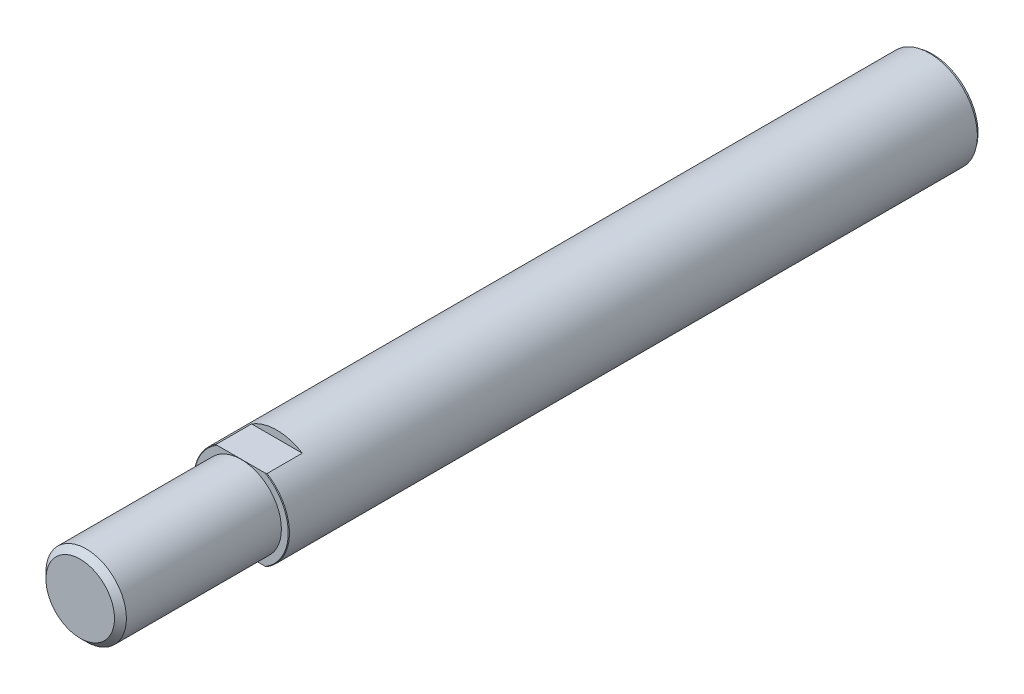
ISO-10303-21;
HEADER;
FILE_DESCRIPTION(('STEP AP214'),'2;1');
FILE_NAME('part.step','',(''),(''),'','','');
FILE_SCHEMA(('AUTOMOTIVE_DESIGN { 1 0 10303 214 1 1 1 1 }'));
ENDSEC;
DATA;
#1=APPLICATION_CONTEXT('core data for automotive mechanical design processes');
#2=APPLICATION_PROTOCOL_DEFINITION('international standard','automotive_design',2000,#1);
#3=PRODUCT_CONTEXT('',#1,'mechanical');
#4=PRODUCT('Part','Part','',(#3));
#5=PRODUCT_RELATED_PRODUCT_CATEGORY('part','',(#4));
#6=PRODUCT_DEFINITION_FORMATION('','',#4);
#7=PRODUCT_DEFINITION_CONTEXT('part definition',#1,'design');
#8=PRODUCT_DEFINITION('design','',#6,#7);
#9=PRODUCT_DEFINITION_SHAPE('','',#8);
#10=(LENGTH_UNIT() NAMED_UNIT(*) SI_UNIT(.MILLI.,.METRE.));
#11=(NAMED_UNIT(*) PLANE_ANGLE_UNIT() SI_UNIT($,.RADIAN.));
#12=(NAMED_UNIT(*) SI_UNIT($,.STERADIAN.) SOLID_ANGLE_UNIT());
#13=UNCERTAINTY_MEASURE_WITH_UNIT(LENGTH_MEASURE(1.E-05),#10,'distance_accuracy_value','');
#14=(GEOMETRIC_REPRESENTATION_CONTEXT(3) GLOBAL_UNCERTAINTY_ASSIGNED_CONTEXT((#13)) GLOBAL_UNIT_ASSIGNED_CONTEXT((#10,
#11,#12)) REPRESENTATION_CONTEXT('',''));
#15=CARTESIAN_POINT('',(0.,0.,0.));
#16=DIRECTION('',(0.,0.,1.));
#17=DIRECTION('',(1.,0.,0.));
#18=AXIS2_PLACEMENT_3D('',#15,#16,#17);
#19=CARTESIAN_POINT('',(0.,0.,286.));
#20=DIRECTION('',(0.,0.,-1.));
#21=DIRECTION('',(-1.,0.,0.));
#22=AXIS2_PLACEMENT_3D('',#19,#20,#21);
#23=CYLINDRICAL_SURFACE('',#22,16.);
#24=DIRECTION('',(0.,0.,-1.));
#25=VECTOR('',#24,1.);
#26=CARTESIAN_POINT('',(-8.50867204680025,-13.55,286.));
#27=LINE('',#26,#25);
#28=CARTESIAN_POINT('',(-8.50867204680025,-13.55,231.8));
#29=VERTEX_POINT('',#28);
#30=CARTESIAN_POINT('',(-8.50867204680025,-13.55,220.));
#31=VERTEX_POINT('',#30);
#32=EDGE_CURVE('E133',#29,#31,#27,.T.);
#33=ORIENTED_EDGE('',*,*,#32,.F.);
#34=CARTESIAN_POINT('',(0.,0.,231.8));
#35=DIRECTION('',(0.,0.,1.));
#36=DIRECTION('',(1.,0.,0.));
#37=AXIS2_PLACEMENT_3D('',#34,#35,#36);
#38=CIRCLE('',#37,16.);
#39=CARTESIAN_POINT('',(-8.50867204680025,13.55,231.8));
#40=VERTEX_POINT('',#39);
#41=EDGE_CURVE('E145',#29,#40,#38,.F.);
#42=ORIENTED_EDGE('',*,*,#41,.T.);
#43=DIRECTION('',(0.,0.,-1.));
#44=VECTOR('',#43,1.);
#45=CARTESIAN_POINT('',(-8.50867204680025,13.55,286.));
#46=LINE('',#45,#44);
#47=CARTESIAN_POINT('',(-8.50867204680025,13.55,220.));
#48=VERTEX_POINT('',#47);
#49=EDGE_CURVE('E58',#48,#40,#46,.F.);
#50=ORIENTED_EDGE('',*,*,#49,.F.);
#51=CARTESIAN_POINT('',(0.,0.,220.));
#52=DIRECTION('',(0.,0.,1.));
#53=DIRECTION('',(1.,0.,0.));
#54=AXIS2_PLACEMENT_3D('',#51,#52,#53);
#55=CIRCLE('',#54,16.);
#56=CARTESIAN_POINT('',(8.50867204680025,13.55,220.));
#57=VERTEX_POINT('',#56);
#58=EDGE_CURVE('E51',#57,#48,#55,.T.);
#59=ORIENTED_EDGE('',*,*,#58,.F.);
#60=DIRECTION('',(0.,0.,-1.));
#61=VECTOR('',#60,1.);
#62=CARTESIAN_POINT('',(8.50867204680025,13.55,286.));
#63=LINE('',#62,#61);
#64=CARTESIAN_POINT('',(8.50867204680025,13.55,231.8));
#65=VERTEX_POINT('',#64);
#66=EDGE_CURVE('E130',#65,#57,#63,.T.);
#67=ORIENTED_EDGE('',*,*,#66,.F.);
#68=CARTESIAN_POINT('',(8.50867204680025,-13.55,231.8));
#69=VERTEX_POINT('',#68);
#70=EDGE_CURVE('E142',#65,#69,#38,.F.);
#71=ORIENTED_EDGE('',*,*,#70,.T.);
#72=DIRECTION('',(0.,0.,-1.));
#73=VECTOR('',#72,1.);
#74=CARTESIAN_POINT('',(8.50867204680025,-13.55,286.));
#75=LINE('',#74,#73);
#76=CARTESIAN_POINT('',(8.50867204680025,-13.55,220.));
#77=VERTEX_POINT('',#76);
#78=EDGE_CURVE('E66',#77,#69,#75,.F.);
#79=ORIENTED_EDGE('',*,*,#78,.F.);
#80=EDGE_CURVE('E12',#31,#77,#55,.T.);
#81=ORIENTED_EDGE('',*,*,#80,.F.);
#82=EDGE_LOOP('',(#33,#42,#50,#59,#67,#71,#79,#81));
#83=FACE_BOUND('',#82,.T.);
#84=CARTESIAN_POINT('',(0.,0.,1.));
#85=DIRECTION('',(0.,0.,-1.));
#86=DIRECTION('',(-1.,0.,0.));
#87=AXIS2_PLACEMENT_3D('',#84,#85,#86);
#88=CIRCLE('',#87,16.);
#89=CARTESIAN_POINT('',(-16.,0.,1.));
#90=VERTEX_POINT('',#89);
#91=EDGE_CURVE('E46',#90,#90,#88,.T.);
#92=ORIENTED_EDGE('',*,*,#91,.F.);
#93=EDGE_LOOP('',(#92));
#94=FACE_BOUND('',#93,.T.);
#95=ADVANCED_FACE('F42',(#83,#94),#23,.T.);
#96=CARTESIAN_POINT('',(0.,0.,232.));
#97=DIRECTION('',(0.,0.,1.));
#98=DIRECTION('',(1.,0.,0.));
#99=AXIS2_PLACEMENT_3D('',#96,#97,#98);
#100=PLANE('',#99);
#101=CARTESIAN_POINT('',(0.,0.,232.));
#102=DIRECTION('',(0.,0.,1.));
#103=DIRECTION('',(1.,0.,0.));
#104=AXIS2_PLACEMENT_3D('',#101,#102,#103);
#105=CIRCLE('',#104,13.5);
#106=CARTESIAN_POINT('',(13.5,0.,232.));
#107=VERTEX_POINT('',#106);
#108=EDGE_CURVE('E135',#107,#107,#105,.T.);
#109=ORIENTED_EDGE('',*,*,#108,.F.);
#110=EDGE_LOOP('',(#109));
#111=FACE_BOUND('',#110,.T.);
#112=CARTESIAN_POINT('',(0.,0.,232.));
#113=DIRECTION('',(0.,0.,1.));
#114=DIRECTION('',(1.,0.,0.));
#115=AXIS2_PLACEMENT_3D('',#112,#113,#114);
#116=CIRCLE('',#115,15.8);
#117=CARTESIAN_POINT('',(-8.12634604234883,13.55,232.));
#118=VERTEX_POINT('',#117);
#119=CARTESIAN_POINT('',(-8.12634604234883,-13.55,232.));
#120=VERTEX_POINT('',#119);
#121=EDGE_CURVE('E141',#118,#120,#116,.T.);
#122=ORIENTED_EDGE('',*,*,#121,.T.);
#123=DIRECTION('',(1.,0.,0.));
#124=VECTOR('',#123,1.);
#125=CARTESIAN_POINT('',(-21.7985101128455,-13.55,232.));
#126=LINE('',#125,#124);
#127=CARTESIAN_POINT('',(8.12634604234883,-13.55,232.));
#128=VERTEX_POINT('',#127);
#129=EDGE_CURVE('E122',#120,#128,#126,.T.);
#130=ORIENTED_EDGE('',*,*,#129,.T.);
#131=CARTESIAN_POINT('',(8.12634604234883,13.55,232.));
#132=VERTEX_POINT('',#131);
#133=EDGE_CURVE('E138',#128,#132,#116,.T.);
#134=ORIENTED_EDGE('',*,*,#133,.T.);
#135=DIRECTION('',(-1.,0.,0.));
#136=VECTOR('',#135,1.);
#137=CARTESIAN_POINT('',(-21.7985101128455,13.55,232.));
#138=LINE('',#137,#136);
#139=EDGE_CURVE('E124',#132,#118,#138,.T.);
#140=ORIENTED_EDGE('',*,*,#139,.T.);
#141=EDGE_LOOP('',(#122,#130,#134,#140));
#142=FACE_BOUND('',#141,.T.);
#143=ADVANCED_FACE('F187',(#111,#142),#100,.T.);
#144=CARTESIAN_POINT('',(0.,0.,232.));
#145=DIRECTION('',(0.,0.,-1.));
#146=DIRECTION('',(-1.,0.,0.));
#147=AXIS2_PLACEMENT_3D('',#144,#145,#146);
#148=CONICAL_SURFACE('',#147,15.8,0.785398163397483);
#149=ORIENTED_EDGE('',*,*,#41,.F.);
#150=CARTESIAN_POINT('',(-32.488120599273,-13.55,212.599425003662));
#151=CARTESIAN_POINT('',(-32.0037413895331,-13.55,213.046466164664));
#152=CARTESIAN_POINT('',(-31.5186355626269,-13.55,213.492721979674));
#153=CARTESIAN_POINT('',(-30.5467487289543,-13.55,214.383412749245));
#154=CARTESIAN_POINT('',(-30.0599677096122,-13.55,214.827847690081));
#155=CARTESIAN_POINT('',(-29.0844075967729,-13.55,215.714738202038));
#156=CARTESIAN_POINT('',(-28.5956280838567,-13.55,216.157193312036));
#157=CARTESIAN_POINT('',(-27.6159099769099,-13.55,217.039705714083));
#158=CARTESIAN_POINT('',(-27.1249713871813,-13.55,217.479763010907));
#159=CARTESIAN_POINT('',(-26.1376779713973,-13.55,218.359716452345));
#160=CARTESIAN_POINT('',(-25.6413083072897,-13.55,218.799595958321));
#161=CARTESIAN_POINT('',(-24.6456712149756,-13.55,219.676063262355));
#162=CARTESIAN_POINT('',(-24.1464037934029,-13.55,220.112651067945));
#163=CARTESIAN_POINT('',(-23.1445514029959,-13.55,220.981895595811));
#164=CARTESIAN_POINT('',(-22.6419668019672,-13.55,221.414552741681));
#165=CARTESIAN_POINT('',(-21.6328509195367,-13.55,222.275241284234));
#166=CARTESIAN_POINT('',(-21.1263196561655,-13.55,222.703272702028));
#167=CARTESIAN_POINT('',(-20.2065441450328,-13.55,223.47190847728));
#168=CARTESIAN_POINT('',(-19.7941106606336,-13.55,223.813482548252));
#169=CARTESIAN_POINT('',(-18.9657498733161,-13.55,224.492365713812));
#170=CARTESIAN_POINT('',(-18.549822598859,-13.55,224.829674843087));
#171=CARTESIAN_POINT('',(-17.7138194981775,-13.55,225.499343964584));
#172=CARTESIAN_POINT('',(-17.2937426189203,-13.55,225.831702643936));
#173=CARTESIAN_POINT('',(-16.4488978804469,-13.55,226.490407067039));
#174=CARTESIAN_POINT('',(-16.024130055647,-13.55,226.816752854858));
#175=CARTESIAN_POINT('',(-15.1695807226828,-13.55,227.461853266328));
#176=CARTESIAN_POINT('',(-14.7398051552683,-13.55,227.780615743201));
#177=CARTESIAN_POINT('',(-13.8738331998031,-13.55,228.409356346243));
#178=CARTESIAN_POINT('',(-13.4376365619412,-13.55,228.719334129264));
#179=CARTESIAN_POINT('',(-12.5579047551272,-13.55,229.328326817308));
#180=CARTESIAN_POINT('',(-12.1143727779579,-13.55,229.627346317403));
#181=CARTESIAN_POINT('',(-11.2185195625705,-13.55,230.211866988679));
#182=CARTESIAN_POINT('',(-10.7661993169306,-13.55,230.497369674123));
#183=CARTESIAN_POINT('',(-9.85664429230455,-13.55,231.048090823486));
#184=CARTESIAN_POINT('',(-9.3995316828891,-13.55,231.313509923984));
#185=CARTESIAN_POINT('',(-8.47356619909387,-13.55,231.823316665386));
#186=CARTESIAN_POINT('',(-8.00471203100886,-13.55,232.067701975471));
#187=CARTESIAN_POINT('',(-7.05420360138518,-13.55,232.529379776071));
#188=CARTESIAN_POINT('',(-6.5725601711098,-13.55,232.746694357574));
#189=CARTESIAN_POINT('',(-5.59514687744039,-13.55,233.147025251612));
#190=CARTESIAN_POINT('',(-5.09938115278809,-13.55,233.330051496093));
#191=CARTESIAN_POINT('',(-4.2033265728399,-13.55,233.61790524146));
#192=CARTESIAN_POINT('',(-3.80573534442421,-13.55,233.731082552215));
#193=CARTESIAN_POINT('',(-3.00299960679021,-13.55,233.926675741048));
#194=CARTESIAN_POINT('',(-2.59785608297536,-13.55,234.009095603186));
#195=CARTESIAN_POINT('',(-1.7832189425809,-13.55,234.139058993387));
#196=CARTESIAN_POINT('',(-1.37374267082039,-13.55,234.186709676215));
#197=CARTESIAN_POINT('',(-0.552137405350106,-13.55,234.244944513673));
#198=CARTESIAN_POINT('',(-0.140008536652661,-13.55,234.255530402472));
#199=CARTESIAN_POINT('',(0.684252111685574,-13.55,234.239005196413));
#200=CARTESIAN_POINT('',(1.09638245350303,-13.55,234.211823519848));
#201=CARTESIAN_POINT('',(1.91660475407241,-13.55,234.121198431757));
#202=CARTESIAN_POINT('',(2.32469637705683,-13.55,234.057752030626));
#203=CARTESIAN_POINT('',(3.13552365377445,-13.55,233.897646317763));
#204=CARTESIAN_POINT('',(3.53823895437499,-13.55,233.800885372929));
#205=CARTESIAN_POINT('',(4.33550774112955,-13.55,233.57845044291));
#206=CARTESIAN_POINT('',(4.73006100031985,-13.55,233.452775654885));
#207=CARTESIAN_POINT('',(5.5684622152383,-13.55,233.156422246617));
#208=CARTESIAN_POINT('',(6.01091651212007,-13.55,232.981830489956));
#209=CARTESIAN_POINT('',(6.88464582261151,-13.55,232.606413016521));
#210=CARTESIAN_POINT('',(7.315915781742,-13.55,232.405575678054));
#211=CARTESIAN_POINT('',(8.1686875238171,-13.55,231.982520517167));
#212=CARTESIAN_POINT('',(8.59017113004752,-13.55,231.760266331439));
#213=CARTESIAN_POINT('',(9.42365509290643,-13.55,231.298868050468));
#214=CARTESIAN_POINT('',(9.83565671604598,-13.55,231.059726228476));
#215=CARTESIAN_POINT('',(10.6563740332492,-13.55,230.564792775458));
#216=CARTESIAN_POINT('',(11.0649881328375,-13.55,230.308833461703));
#217=CARTESIAN_POINT('',(11.8748731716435,-13.55,229.785572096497));
#218=CARTESIAN_POINT('',(12.2761439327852,-13.55,229.518269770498));
#219=CARTESIAN_POINT('',(13.0719274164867,-13.55,228.974659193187));
#220=CARTESIAN_POINT('',(13.4664465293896,-13.55,228.698360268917));
#221=CARTESIAN_POINT('',(14.2499951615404,-13.55,228.138111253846));
#222=CARTESIAN_POINT('',(14.6390247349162,-13.55,227.854161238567));
#223=CARTESIAN_POINT('',(15.4205821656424,-13.55,227.273750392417));
#224=CARTESIAN_POINT('',(15.8130076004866,-13.55,226.977151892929));
#225=CARTESIAN_POINT('',(16.5935743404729,-13.55,226.378362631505));
#226=CARTESIAN_POINT('',(16.9817155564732,-13.55,226.076171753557));
#227=CARTESIAN_POINT('',(17.7542964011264,-13.55,225.467040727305));
#228=CARTESIAN_POINT('',(18.1387357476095,-13.55,225.160100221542));
#229=CARTESIAN_POINT('',(18.904356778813,-13.55,224.542179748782));
#230=CARTESIAN_POINT('',(19.2855384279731,-13.55,224.231199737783));
#231=CARTESIAN_POINT('',(20.4253968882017,-13.55,223.292597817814));
#232=CARTESIAN_POINT('',(21.1797977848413,-13.55,222.659781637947));
#233=CARTESIAN_POINT('',(22.6797481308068,-13.55,221.383746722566));
#234=CARTESIAN_POINT('',(23.4252973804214,-13.55,220.740527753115));
#235=CARTESIAN_POINT('',(24.5192457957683,-13.55,219.786316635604));
#236=CARTESIAN_POINT('',(24.870373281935,-13.55,219.478444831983));
#237=CARTESIAN_POINT('',(25.5711940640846,-13.55,218.861082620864));
#238=CARTESIAN_POINT('',(25.9208873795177,-13.55,218.551592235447));
#239=CARTESIAN_POINT('',(26.9680519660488,-13.55,217.620937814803));
#240=CARTESIAN_POINT('',(27.6635941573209,-13.55,216.997602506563));
#241=CARTESIAN_POINT('',(29.049310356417,-13.55,215.747297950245));
#242=CARTESIAN_POINT('',(29.7394913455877,-13.55,215.120336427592));
#243=CARTESIAN_POINT('',(31.1162973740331,-13.55,213.862571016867));
#244=CARTESIAN_POINT('',(31.8029225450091,-13.55,213.231767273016));
#245=CARTESIAN_POINT('',(32.488120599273,-13.55,212.599425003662));
#246=B_SPLINE_CURVE_WITH_KNOTS('',3,(#150,#151,#152,#153,#154,#155,#156,#157,#158,#159,#160,
#161,#162,#163,#164,#165,#166,#167,#168,#169,#170,#171,#172,#173,#174,#175,#176,#177,#178,#179,
#180,#181,#182,#183,#184,#185,#186,#187,#188,#189,#190,#191,#192,#193,#194,#195,#196,#197,#198,
#199,#200,#201,#202,#203,#204,#205,#206,#207,#208,#209,#210,#211,#212,#213,#214,#215,#216,#217,
#218,#219,#220,#221,#222,#223,#224,#225,#226,#227,#228,#229,#230,#231,#232,#233,#234,#235,#236,
#237,#238,#239,#240,#241,#242,#243,#244,#245),.UNSPECIFIED.,.F.,.F.,(4,2,2,2,2,2,2,2,2,2,2,2,2,
2,2,2,2,2,2,2,2,2,2,2,2,2,2,2,2,2,2,2,2,2,2,2,2,2,2,2,2,2,2,2,2,2,2,4),(0.,1.97742902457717,
3.95487292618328,5.93275563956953,7.91063441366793,9.9003183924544,11.8899978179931,
13.8794602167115,15.8689135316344,17.4754290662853,19.081931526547,20.688852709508,
22.2957621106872,23.9009277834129,25.5061560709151,27.1107033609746,28.7150704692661,
30.3003831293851,31.8858712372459,33.4700569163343,35.0537830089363,36.2929033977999,
37.5318632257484,38.7669884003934,40.0020557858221,41.2394344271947,42.4769150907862,
43.7182049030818,44.9595291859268,46.3854300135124,47.8119643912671,49.2409650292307,
50.6697736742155,52.1160334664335,53.5623282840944,55.0071686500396,56.4519947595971,
57.9276439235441,59.403323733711,60.8791151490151,62.3549226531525,65.3087944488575,
68.2627327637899,69.6636854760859,71.0646191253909,73.8665410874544,76.6638239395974,
79.4610024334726),.UNSPECIFIED.);
#247=EDGE_CURVE('E337',#29,#120,#246,.T.);
#248=ORIENTED_EDGE('',*,*,#247,.T.);
#249=ORIENTED_EDGE('',*,*,#121,.F.);
#250=CARTESIAN_POINT('',(32.488120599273,13.55,212.599425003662));
#251=CARTESIAN_POINT('',(32.0037413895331,13.55,213.046466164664));
#252=CARTESIAN_POINT('',(31.5186355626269,13.55,213.492721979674));
#253=CARTESIAN_POINT('',(30.5467487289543,13.55,214.383412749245));
#254=CARTESIAN_POINT('',(30.0599677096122,13.55,214.827847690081));
#255=CARTESIAN_POINT('',(29.0844075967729,13.55,215.714738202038));
#256=CARTESIAN_POINT('',(28.5956280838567,13.55,216.157193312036));
#257=CARTESIAN_POINT('',(27.6159099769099,13.55,217.039705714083));
#258=CARTESIAN_POINT('',(27.1249713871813,13.55,217.479763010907));
#259=CARTESIAN_POINT('',(26.1376779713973,13.55,218.359716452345));
#260=CARTESIAN_POINT('',(25.6413083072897,13.55,218.799595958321));
#261=CARTESIAN_POINT('',(24.6456712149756,13.55,219.676063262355));
#262=CARTESIAN_POINT('',(24.1464037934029,13.55,220.112651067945));
#263=CARTESIAN_POINT('',(23.1445514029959,13.55,220.981895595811));
#264=CARTESIAN_POINT('',(22.6419668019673,13.55,221.414552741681));
#265=CARTESIAN_POINT('',(21.6328509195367,13.55,222.275241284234));
#266=CARTESIAN_POINT('',(21.1263196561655,13.55,222.703272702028));
#267=CARTESIAN_POINT('',(20.2065441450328,13.55,223.47190847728));
#268=CARTESIAN_POINT('',(19.7941106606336,13.55,223.813482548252));
#269=CARTESIAN_POINT('',(18.965749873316,13.55,224.492365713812));
#270=CARTESIAN_POINT('',(18.549822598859,13.55,224.829674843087));
#271=CARTESIAN_POINT('',(17.7138194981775,13.55,225.499343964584));
#272=CARTESIAN_POINT('',(17.2937426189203,13.55,225.831702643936));
#273=CARTESIAN_POINT('',(16.4488978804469,13.55,226.490407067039));
#274=CARTESIAN_POINT('',(16.024130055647,13.55,226.816752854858));
#275=CARTESIAN_POINT('',(15.1695807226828,13.55,227.461853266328));
#276=CARTESIAN_POINT('',(14.7398051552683,13.55,227.780615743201));
#277=CARTESIAN_POINT('',(13.8738331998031,13.55,228.409356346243));
#278=CARTESIAN_POINT('',(13.4376365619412,13.55,228.719334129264));
#279=CARTESIAN_POINT('',(12.5579047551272,13.55,229.328326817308));
#280=CARTESIAN_POINT('',(12.1143727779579,13.55,229.627346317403));
#281=CARTESIAN_POINT('',(11.2185195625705,13.55,230.211866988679));
#282=CARTESIAN_POINT('',(10.7661993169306,13.55,230.497369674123));
#283=CARTESIAN_POINT('',(9.85664429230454,13.55,231.048090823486));
#284=CARTESIAN_POINT('',(9.3995316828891,13.55,231.313509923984));
#285=CARTESIAN_POINT('',(8.47356619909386,13.55,231.823316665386));
#286=CARTESIAN_POINT('',(8.00471203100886,13.55,232.067701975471));
#287=CARTESIAN_POINT('',(7.05420360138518,13.55,232.529379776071));
#288=CARTESIAN_POINT('',(6.57256017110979,13.55,232.746694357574));
#289=CARTESIAN_POINT('',(5.59514687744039,13.55,233.147025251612));
#290=CARTESIAN_POINT('',(5.09938115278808,13.55,233.330051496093));
#291=CARTESIAN_POINT('',(4.20332657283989,13.55,233.61790524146));
#292=CARTESIAN_POINT('',(3.80573534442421,13.55,233.731082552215));
#293=CARTESIAN_POINT('',(3.00299960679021,13.55,233.926675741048));
#294=CARTESIAN_POINT('',(2.59785608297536,13.55,234.009095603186));
#295=CARTESIAN_POINT('',(1.7832189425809,13.55,234.139058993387));
#296=CARTESIAN_POINT('',(1.3737426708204,13.55,234.186709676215));
#297=CARTESIAN_POINT('',(0.552137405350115,13.55,234.244944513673));
#298=CARTESIAN_POINT('',(0.14000853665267,13.55,234.255530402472));
#299=CARTESIAN_POINT('',(-0.684252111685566,13.55,234.239005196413));
#300=CARTESIAN_POINT('',(-1.09638245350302,13.55,234.211823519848));
#301=CARTESIAN_POINT('',(-1.9166047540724,13.55,234.121198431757));
#302=CARTESIAN_POINT('',(-2.32469637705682,13.55,234.057752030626));
#303=CARTESIAN_POINT('',(-3.13552365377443,13.55,233.897646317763));
#304=CARTESIAN_POINT('',(-3.53823895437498,13.55,233.800885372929));
#305=CARTESIAN_POINT('',(-4.33550774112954,13.55,233.57845044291));
#306=CARTESIAN_POINT('',(-4.73006100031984,13.55,233.452775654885));
#307=CARTESIAN_POINT('',(-5.56846221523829,13.55,233.156422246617));
#308=CARTESIAN_POINT('',(-6.01091651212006,13.55,232.981830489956));
#309=CARTESIAN_POINT('',(-6.88464582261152,13.55,232.606413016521));
#310=CARTESIAN_POINT('',(-7.31591578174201,13.55,232.405575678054));
#311=CARTESIAN_POINT('',(-8.16868752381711,13.55,231.982520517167));
#312=CARTESIAN_POINT('',(-8.59017113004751,13.55,231.760266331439));
#313=CARTESIAN_POINT('',(-9.42365509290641,13.55,231.298868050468));
#314=CARTESIAN_POINT('',(-9.83565671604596,13.55,231.059726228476));
#315=CARTESIAN_POINT('',(-10.6563740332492,13.55,230.564792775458));
#316=CARTESIAN_POINT('',(-11.0649881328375,13.55,230.308833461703));
#317=CARTESIAN_POINT('',(-11.8748731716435,13.55,229.785572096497));
#318=CARTESIAN_POINT('',(-12.2761439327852,13.55,229.518269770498));
#319=CARTESIAN_POINT('',(-13.0719274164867,13.55,228.974659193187));
#320=CARTESIAN_POINT('',(-13.4664465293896,13.55,228.698360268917));
#321=CARTESIAN_POINT('',(-14.2499951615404,13.55,228.138111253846));
#322=CARTESIAN_POINT('',(-14.6390247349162,13.55,227.854161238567));
#323=CARTESIAN_POINT('',(-15.4205821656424,13.55,227.273750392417));
#324=CARTESIAN_POINT('',(-15.8130076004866,13.55,226.977151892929));
#325=CARTESIAN_POINT('',(-16.5935743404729,13.55,226.378362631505));
#326=CARTESIAN_POINT('',(-16.9817155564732,13.55,226.076171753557));
#327=CARTESIAN_POINT('',(-17.7542964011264,13.55,225.467040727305));
#328=CARTESIAN_POINT('',(-18.1387357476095,13.55,225.160100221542));
#329=CARTESIAN_POINT('',(-18.904356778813,13.55,224.542179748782));
#330=CARTESIAN_POINT('',(-19.2855384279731,13.55,224.231199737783));
#331=CARTESIAN_POINT('',(-20.4253968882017,13.55,223.292597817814));
#332=CARTESIAN_POINT('',(-21.1797977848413,13.55,222.659781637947));
#333=CARTESIAN_POINT('',(-22.6797481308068,13.55,221.383746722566));
#334=CARTESIAN_POINT('',(-23.4252973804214,13.55,220.740527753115));
#335=CARTESIAN_POINT('',(-24.5192457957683,13.55,219.786316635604));
#336=CARTESIAN_POINT('',(-24.870373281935,13.55,219.478444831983));
#337=CARTESIAN_POINT('',(-25.5711940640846,13.55,218.861082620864));
#338=CARTESIAN_POINT('',(-25.9208873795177,13.55,218.551592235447));
#339=CARTESIAN_POINT('',(-26.9680519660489,13.55,217.620937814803));
#340=CARTESIAN_POINT('',(-27.6635941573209,13.55,216.997602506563));
#341=CARTESIAN_POINT('',(-29.049310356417,13.55,215.747297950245));
#342=CARTESIAN_POINT('',(-29.7394913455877,13.55,215.120336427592));
#343=CARTESIAN_POINT('',(-31.1162973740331,13.55,213.862571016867));
#344=CARTESIAN_POINT('',(-31.8029225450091,13.55,213.231767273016));
#345=CARTESIAN_POINT('',(-32.488120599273,13.55,212.599425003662));
#346=B_SPLINE_CURVE_WITH_KNOTS('',3,(#250,#251,#252,#253,#254,#255,#256,#257,#258,#259,#260,
#261,#262,#263,#264,#265,#266,#267,#268,#269,#270,#271,#272,#273,#274,#275,#276,#277,#278,#279,
#280,#281,#282,#283,#284,#285,#286,#287,#288,#289,#290,#291,#292,#293,#294,#295,#296,#297,#298,
#299,#300,#301,#302,#303,#304,#305,#306,#307,#308,#309,#310,#311,#312,#313,#314,#315,#316,#317,
#318,#319,#320,#321,#322,#323,#324,#325,#326,#327,#328,#329,#330,#331,#332,#333,#334,#335,#336,
#337,#338,#339,#340,#341,#342,#343,#344,#345),.UNSPECIFIED.,.F.,.F.,(4,2,2,2,2,2,2,2,2,2,2,2,2,
2,2,2,2,2,2,2,2,2,2,2,2,2,2,2,2,2,2,2,2,2,2,2,2,2,2,2,2,2,2,2,2,2,2,4),(0.,1.97742902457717,
3.95487292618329,5.93275563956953,7.91063441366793,9.9003183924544,11.8899978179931,
13.8794602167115,15.8689135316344,17.4754290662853,19.081931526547,20.688852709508,
22.2957621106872,23.9009277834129,25.5061560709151,27.1107033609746,28.7150704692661,
30.3003831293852,31.8858712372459,33.4700569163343,35.0537830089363,36.2929033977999,
37.5318632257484,38.7669884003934,40.0020557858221,41.2394344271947,42.4769150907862,
43.7182049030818,44.9595291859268,46.3854300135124,47.8119643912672,49.2409650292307,
50.6697736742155,52.1160334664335,53.5623282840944,55.0071686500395,56.4519947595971,
57.9276439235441,59.403323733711,60.8791151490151,62.3549226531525,65.3087944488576,
68.2627327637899,69.663685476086,71.0646191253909,73.8665410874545,76.6638239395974,
79.4610024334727),.UNSPECIFIED.);
#347=EDGE_CURVE('E152',#118,#40,#346,.T.);
#348=ORIENTED_EDGE('',*,*,#347,.T.);
#349=EDGE_LOOP('',(#149,#248,#249,#348));
#350=FACE_BOUND('',#349,.T.);
#351=ADVANCED_FACE('F166',(#350),#148,.T.);
#352=ORIENTED_EDGE('',*,*,#133,.F.);
#353=EDGE_CURVE('E160',#128,#69,#246,.T.);
#354=ORIENTED_EDGE('',*,*,#353,.T.);
#355=ORIENTED_EDGE('',*,*,#70,.F.);
#356=EDGE_CURVE('E159',#65,#132,#346,.T.);
#357=ORIENTED_EDGE('',*,*,#356,.T.);
#358=EDGE_LOOP('',(#352,#354,#355,#357));
#359=FACE_BOUND('',#358,.T.);
#360=ADVANCED_FACE('F185',(#359),#148,.T.);
#361=CARTESIAN_POINT('',(0.,0.,232.));
#362=DIRECTION('',(0.,0.,1.));
#363=DIRECTION('',(1.,0.,0.));
#364=AXIS2_PLACEMENT_3D('',#361,#362,#363);
#365=CYLINDRICAL_SURFACE('',#364,13.5);
#366=CARTESIAN_POINT('',(0.,0.,284.));
#367=DIRECTION('',(0.,0.,1.));
#368=DIRECTION('',(1.,0.,0.));
#369=AXIS2_PLACEMENT_3D('',#366,#367,#368);
#370=CIRCLE('',#369,13.5);
#371=CARTESIAN_POINT('',(13.5,0.,284.));
#372=VERTEX_POINT('',#371);
#373=EDGE_CURVE('E149',#372,#372,#370,.F.);
#374=ORIENTED_EDGE('',*,*,#373,.T.);
#375=EDGE_LOOP('',(#374));
#376=FACE_BOUND('',#375,.T.);
#377=ORIENTED_EDGE('',*,*,#108,.T.);
#378=EDGE_LOOP('',(#377));
#379=FACE_BOUND('',#378,.T.);
#380=ADVANCED_FACE('F181',(#376,#379),#365,.T.);
#381=CARTESIAN_POINT('',(0.,0.,286.));
#382=DIRECTION('',(0.,0.,1.));
#383=DIRECTION('',(1.,0.,0.));
#384=AXIS2_PLACEMENT_3D('',#381,#382,#383);
#385=PLANE('',#384);
#386=CARTESIAN_POINT('',(0.,0.,286.));
#387=DIRECTION('',(0.,0.,1.));
#388=DIRECTION('',(1.,0.,0.));
#389=AXIS2_PLACEMENT_3D('',#386,#387,#388);
#390=CIRCLE('',#389,11.5);
#391=CARTESIAN_POINT('',(11.5,0.,286.));
#392=VERTEX_POINT('',#391);
#393=EDGE_CURVE('E146',#392,#392,#390,.T.);
#394=ORIENTED_EDGE('',*,*,#393,.T.);
#395=EDGE_LOOP('',(#394));
#396=FACE_BOUND('',#395,.T.);
#397=ADVANCED_FACE('F184',(#396),#385,.T.);
#398=CARTESIAN_POINT('',(0.,0.,286.));
#399=DIRECTION('',(0.,0.,-1.));
#400=DIRECTION('',(-1.,0.,0.));
#401=AXIS2_PLACEMENT_3D('',#398,#399,#400);
#402=CONICAL_SURFACE('',#401,11.5,0.785398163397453);
#403=ORIENTED_EDGE('',*,*,#373,.F.);
#404=EDGE_LOOP('',(#403));
#405=FACE_BOUND('',#404,.T.);
#406=ORIENTED_EDGE('',*,*,#393,.F.);
#407=EDGE_LOOP('',(#406));
#408=FACE_BOUND('',#407,.T.);
#409=ADVANCED_FACE('F44',(#405,#408),#402,.T.);
#410=CARTESIAN_POINT('',(-21.7985101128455,13.55,220.));
#411=DIRECTION('',(0.,1.,0.));
#412=DIRECTION('',(0.,0.,1.));
#413=AXIS2_PLACEMENT_3D('',#410,#411,#412);
#414=PLANE('',#413);
#415=ORIENTED_EDGE('',*,*,#66,.T.);
#416=DIRECTION('',(-1.,0.,0.));
#417=VECTOR('',#416,1.);
#418=CARTESIAN_POINT('',(-21.7985101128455,13.55,220.));
#419=LINE('',#418,#417);
#420=EDGE_CURVE('E119',#57,#48,#419,.T.);
#421=ORIENTED_EDGE('',*,*,#420,.T.);
#422=ORIENTED_EDGE('',*,*,#49,.T.);
#423=ORIENTED_EDGE('',*,*,#347,.F.);
#424=ORIENTED_EDGE('',*,*,#139,.F.);
#425=ORIENTED_EDGE('',*,*,#356,.F.);
#426=EDGE_LOOP('',(#415,#421,#422,#423,#424,#425));
#427=FACE_BOUND('',#426,.T.);
#428=ADVANCED_FACE('F169',(#427),#414,.T.);
#429=CARTESIAN_POINT('',(0.,0.,220.));
#430=DIRECTION('',(0.,0.,1.));
#431=DIRECTION('',(1.,0.,0.));
#432=AXIS2_PLACEMENT_3D('',#429,#430,#431);
#433=PLANE('',#432);
#434=ORIENTED_EDGE('',*,*,#58,.T.);
#435=ORIENTED_EDGE('',*,*,#420,.F.);
#436=EDGE_LOOP('',(#434,#435));
#437=FACE_BOUND('',#436,.T.);
#438=ADVANCED_FACE('F173',(#437),#433,.T.);
#439=ORIENTED_EDGE('',*,*,#80,.T.);
#440=DIRECTION('',(1.,0.,0.));
#441=VECTOR('',#440,1.);
#442=CARTESIAN_POINT('',(-21.7985101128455,-13.55,220.));
#443=LINE('',#442,#441);
#444=EDGE_CURVE('E121',#31,#77,#443,.T.);
#445=ORIENTED_EDGE('',*,*,#444,.F.);
#446=EDGE_LOOP('',(#439,#445));
#447=FACE_BOUND('',#446,.T.);
#448=ADVANCED_FACE('F179',(#447),#433,.T.);
#449=CARTESIAN_POINT('',(-21.7985101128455,-13.55,220.));
#450=DIRECTION('',(0.,-1.,0.));
#451=DIRECTION('',(0.,0.,-1.));
#452=AXIS2_PLACEMENT_3D('',#449,#450,#451);
#453=PLANE('',#452);
#454=ORIENTED_EDGE('',*,*,#32,.T.);
#455=ORIENTED_EDGE('',*,*,#444,.T.);
#456=ORIENTED_EDGE('',*,*,#78,.T.);
#457=ORIENTED_EDGE('',*,*,#353,.F.);
#458=ORIENTED_EDGE('',*,*,#129,.F.);
#459=ORIENTED_EDGE('',*,*,#247,.F.);
#460=EDGE_LOOP('',(#454,#455,#456,#457,#458,#459));
#461=FACE_BOUND('',#460,.T.);
#462=ADVANCED_FACE('F174',(#461),#453,.T.);
#463=CARTESIAN_POINT('',(0.,0.,1.));
#464=DIRECTION('',(0.,0.,-1.));
#465=DIRECTION('',(-1.,0.,0.));
#466=AXIS2_PLACEMENT_3D('',#463,#464,#465);
#467=PLANE('',#466);
#468=CARTESIAN_POINT('',(0.,0.,1.));
#469=DIRECTION('',(0.,0.,-1.));
#470=DIRECTION('',(-1.,0.,0.));
#471=AXIS2_PLACEMENT_3D('',#468,#469,#470);
#472=CIRCLE('',#471,15.25);
#473=CARTESIAN_POINT('',(-15.25,0.,1.));
#474=VERTEX_POINT('',#473);
#475=EDGE_CURVE('E112',#474,#474,#472,.T.);
#476=ORIENTED_EDGE('',*,*,#475,.F.);
#477=EDGE_LOOP('',(#476));
#478=FACE_BOUND('',#477,.T.);
#479=ORIENTED_EDGE('',*,*,#91,.T.);
#480=EDGE_LOOP('',(#479));
#481=FACE_BOUND('',#480,.T.);
#482=ADVANCED_FACE('F209',(#478,#481),#467,.T.);
#483=CARTESIAN_POINT('',(0.,0.,1.));
#484=DIRECTION('',(0.,0.,-1.));
#485=DIRECTION('',(-1.,0.,0.));
#486=AXIS2_PLACEMENT_3D('',#483,#484,#485);
#487=CYLINDRICAL_SURFACE('',#486,15.25);
#488=ORIENTED_EDGE('',*,*,#475,.T.);
#489=EDGE_LOOP('',(#488));
#490=FACE_BOUND('',#489,.T.);
#491=CARTESIAN_POINT('',(0.,0.,0.));
#492=DIRECTION('',(0.,0.,-1.));
#493=DIRECTION('',(-1.,0.,0.));
#494=AXIS2_PLACEMENT_3D('',#491,#492,#493);
#495=CIRCLE('',#494,15.25);
#496=CARTESIAN_POINT('',(-15.25,0.,0.));
#497=VERTEX_POINT('',#496);
#498=EDGE_CURVE('E108',#497,#497,#495,.T.);
#499=ORIENTED_EDGE('',*,*,#498,.F.);
#500=EDGE_LOOP('',(#499));
#501=FACE_BOUND('',#500,.T.);
#502=ADVANCED_FACE('F195',(#490,#501),#487,.T.);
#503=CARTESIAN_POINT('',(0.,0.,0.));
#504=DIRECTION('',(0.,0.,1.));
#505=DIRECTION('',(1.,0.,0.));
#506=AXIS2_PLACEMENT_3D('',#503,#504,#505);
#507=PLANE('',#506);
#508=CARTESIAN_POINT('',(0.,0.,0.));
#509=DIRECTION('',(0.,0.,-1.));
#510=DIRECTION('',(-1.,0.,0.));
#511=AXIS2_PLACEMENT_3D('',#508,#509,#510);
#512=CIRCLE('',#511,5.09999999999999);
#513=CARTESIAN_POINT('',(-5.09999999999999,0.,0.));
#514=VERTEX_POINT('',#513);
#515=EDGE_CURVE('E109',#514,#514,#512,.T.);
#516=ORIENTED_EDGE('',*,*,#515,.F.);
#517=EDGE_LOOP('',(#516));
#518=FACE_BOUND('',#517,.T.);
#519=ORIENTED_EDGE('',*,*,#498,.T.);
#520=EDGE_LOOP('',(#519));
#521=FACE_BOUND('',#520,.T.);
#522=ADVANCED_FACE('F102',(#518,#521),#507,.F.);
#523=CARTESIAN_POINT('',(0.,0.,32.75));
#524=DIRECTION('',(0.,0.,-1.));
#525=DIRECTION('',(-1.,0.,0.));
#526=AXIS2_PLACEMENT_3D('',#523,#524,#525);
#527=CONICAL_SURFACE('',#526,5.09999999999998,1.02974425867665);
#528=CARTESIAN_POINT('',(0.,0.,35.8143891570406));
#529=VERTEX_POINT('',#528);
#530=VERTEX_LOOP('',#529);
#531=FACE_BOUND('',#530,.T.);
#532=CARTESIAN_POINT('',(0.,0.,32.75));
#533=DIRECTION('',(0.,0.,-1.));
#534=DIRECTION('',(-1.,0.,0.));
#535=AXIS2_PLACEMENT_3D('',#532,#533,#534);
#536=CIRCLE('',#535,5.09999999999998);
#537=CARTESIAN_POINT('',(-5.09999999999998,0.,32.75));
#538=VERTEX_POINT('',#537);
#539=EDGE_CURVE('E106',#538,#538,#536,.T.);
#540=ORIENTED_EDGE('',*,*,#539,.T.);
#541=EDGE_LOOP('',(#540));
#542=FACE_BOUND('',#541,.T.);
#543=ADVANCED_FACE('F98',(#531,#542),#527,.F.);
#544=CARTESIAN_POINT('',(0.,0.,0.));
#545=DIRECTION('',(0.,0.,-1.));
#546=DIRECTION('',(-1.,0.,0.));
#547=AXIS2_PLACEMENT_3D('',#544,#545,#546);
#548=CYLINDRICAL_SURFACE('',#547,5.09999999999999);
#549=ORIENTED_EDGE('',*,*,#539,.F.);
#550=EDGE_LOOP('',(#549));
#551=FACE_BOUND('',#550,.T.);
#552=ORIENTED_EDGE('',*,*,#515,.T.);
#553=EDGE_LOOP('',(#552));
#554=FACE_BOUND('',#553,.T.);
#555=ADVANCED_FACE('F101',(#551,#554),#548,.F.);
#556=CLOSED_SHELL('',(#95,#143,#351,#360,#380,#397,#409,#428,#438,#448,#462,#482,#502,#522,#543,#555));
#557=MANIFOLD_SOLID_BREP('B2',#556);
#558=ADVANCED_BREP_SHAPE_REPRESENTATION('',(#18,#557),#14);
#559=SHAPE_DEFINITION_REPRESENTATION(#9,#558);
ENDSEC;
END-ISO-10303-21;
